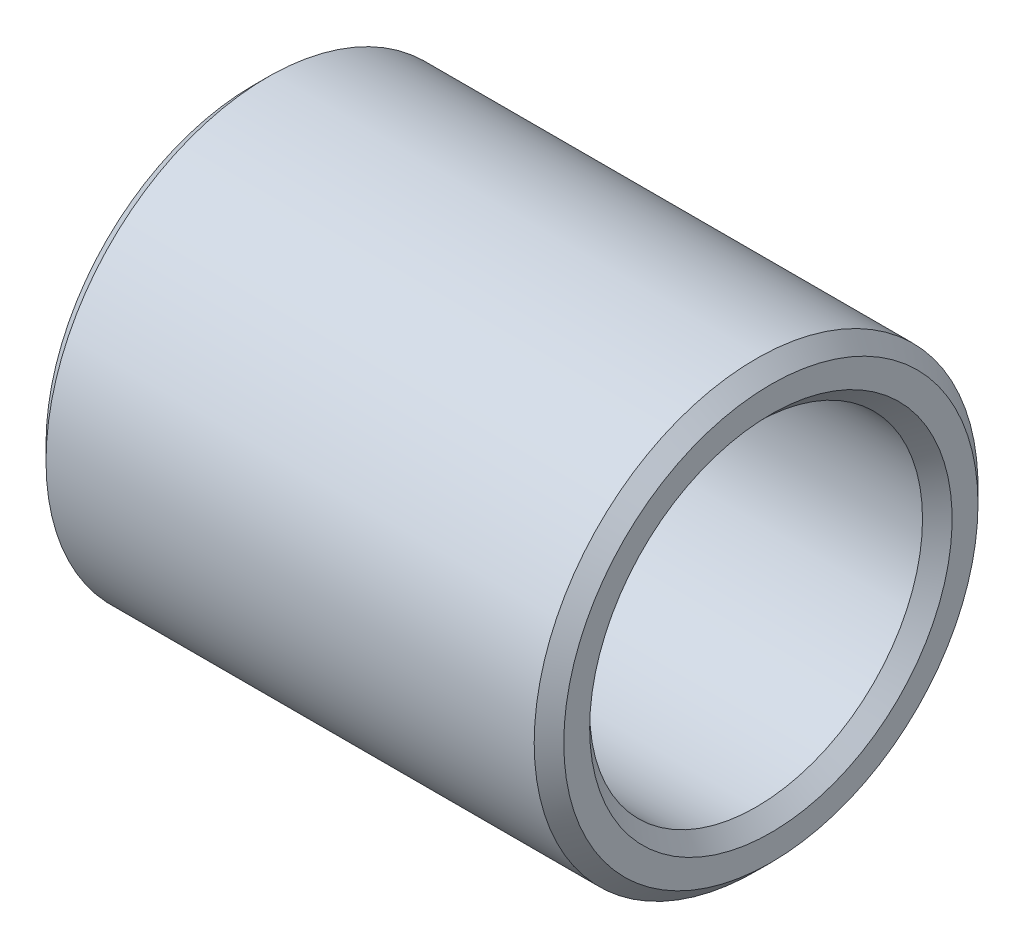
from build123d import *


with BuildPart() as part:
    # Esquisse1 → Base-R_volution (revolve)
    with BuildSketch(Plane.XY, mode=Mode.PRIVATE) as base_r_volution_sk:
        Polygon((-7, 4.9), (-7, 5.6), (-6.6, 6), (6.6, 6), (7, 5.6), (7, 4.9), (6.6, 4.5), (-6.6, 4.5), align=None)
    revolve(base_r_volution_sk.sketch.rotate(Axis((0, 0, 0), (1, 0, 0)), 90), axis=Axis((0, 0, 0), (1, 0, 0)))


solid = part.part
